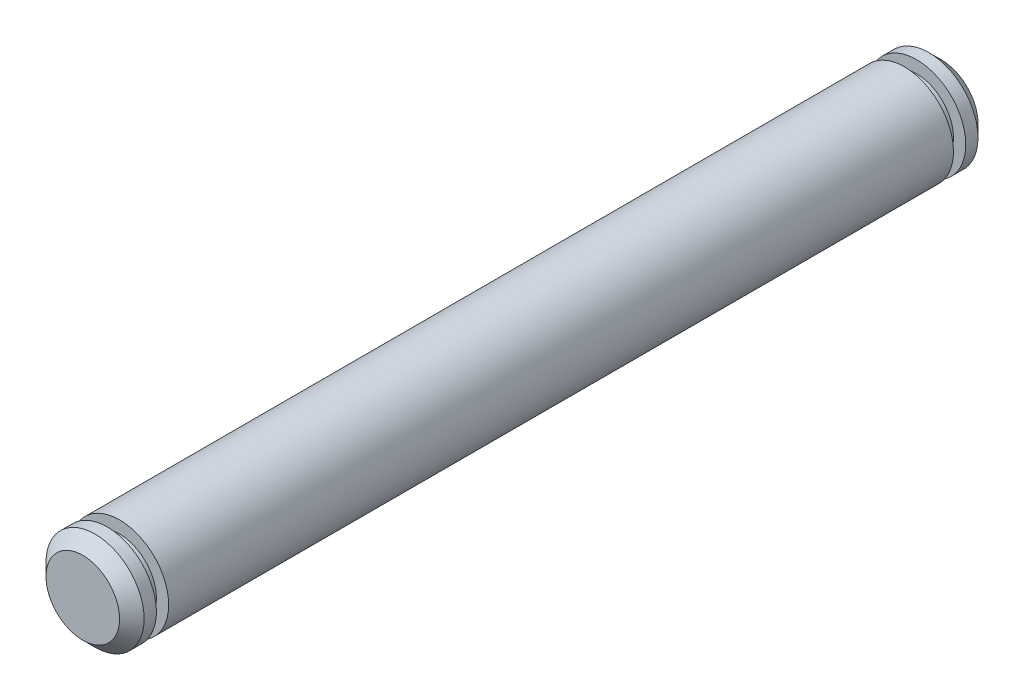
ISO-10303-21;
HEADER;
FILE_DESCRIPTION(('STEP AP214'),'2;1');
FILE_NAME('part.step','',(''),(''),'','','');
FILE_SCHEMA(('AUTOMOTIVE_DESIGN { 1 0 10303 214 1 1 1 1 }'));
ENDSEC;
DATA;
#1=APPLICATION_CONTEXT('core data for automotive mechanical design processes');
#2=APPLICATION_PROTOCOL_DEFINITION('international standard','automotive_design',2000,#1);
#3=PRODUCT_CONTEXT('',#1,'mechanical');
#4=PRODUCT('Part','Part','',(#3));
#5=PRODUCT_RELATED_PRODUCT_CATEGORY('part','',(#4));
#6=PRODUCT_DEFINITION_FORMATION('','',#4);
#7=PRODUCT_DEFINITION_CONTEXT('part definition',#1,'design');
#8=PRODUCT_DEFINITION('design','',#6,#7);
#9=PRODUCT_DEFINITION_SHAPE('','',#8);
#10=(LENGTH_UNIT() NAMED_UNIT(*) SI_UNIT(.MILLI.,.METRE.));
#11=(NAMED_UNIT(*) PLANE_ANGLE_UNIT() SI_UNIT($,.RADIAN.));
#12=(NAMED_UNIT(*) SI_UNIT($,.STERADIAN.) SOLID_ANGLE_UNIT());
#13=UNCERTAINTY_MEASURE_WITH_UNIT(LENGTH_MEASURE(1.E-05),#10,'distance_accuracy_value','');
#14=(GEOMETRIC_REPRESENTATION_CONTEXT(3) GLOBAL_UNCERTAINTY_ASSIGNED_CONTEXT((#13)) GLOBAL_UNIT_ASSIGNED_CONTEXT((#10,
#11,#12)) REPRESENTATION_CONTEXT('',''));
#15=CARTESIAN_POINT('',(0.,0.,0.));
#16=DIRECTION('',(0.,0.,1.));
#17=DIRECTION('',(1.,0.,0.));
#18=AXIS2_PLACEMENT_3D('',#15,#16,#17);
#19=CARTESIAN_POINT('',(-8.,0.,67.));
#20=DIRECTION('',(0.,0.,1.));
#21=DIRECTION('',(1.,0.,0.));
#22=AXIS2_PLACEMENT_3D('',#19,#20,#21);
#23=PLANE('',#22);
#24=CARTESIAN_POINT('',(0.,0.,67.));
#25=DIRECTION('',(0.,0.,-1.));
#26=DIRECTION('',(-1.,0.,0.));
#27=AXIS2_PLACEMENT_3D('',#24,#25,#26);
#28=CIRCLE('',#27,3.);
#29=CARTESIAN_POINT('',(-3.,0.,67.));
#30=VERTEX_POINT('',#29);
#31=EDGE_CURVE('E53',#30,#30,#28,.T.);
#32=ORIENTED_EDGE('',*,*,#31,.T.);
#33=EDGE_LOOP('',(#32));
#34=FACE_BOUND('',#33,.T.);
#35=CARTESIAN_POINT('',(0.,0.,67.));
#36=DIRECTION('',(0.,0.,1.));
#37=DIRECTION('',(1.,0.,0.));
#38=AXIS2_PLACEMENT_3D('',#35,#36,#37);
#39=CIRCLE('',#38,4.);
#40=CARTESIAN_POINT('',(4.,0.,67.));
#41=VERTEX_POINT('',#40);
#42=EDGE_CURVE('E46',#41,#41,#39,.T.);
#43=ORIENTED_EDGE('',*,*,#42,.T.);
#44=EDGE_LOOP('',(#43));
#45=FACE_BOUND('',#44,.T.);
#46=ADVANCED_FACE('F25',(#34,#45),#23,.T.);
#47=CARTESIAN_POINT('',(-3.,0.,68.));
#48=DIRECTION('',(0.,0.,-1.));
#49=DIRECTION('',(-1.,0.,0.));
#50=AXIS2_PLACEMENT_3D('',#47,#48,#49);
#51=PLANE('',#50);
#52=CARTESIAN_POINT('',(0.,0.,68.));
#53=DIRECTION('',(0.,0.,-1.));
#54=DIRECTION('',(-1.,0.,0.));
#55=AXIS2_PLACEMENT_3D('',#52,#53,#54);
#56=CIRCLE('',#55,3.);
#57=CARTESIAN_POINT('',(-3.,0.,68.));
#58=VERTEX_POINT('',#57);
#59=EDGE_CURVE('E66',#58,#58,#56,.T.);
#60=ORIENTED_EDGE('',*,*,#59,.F.);
#61=EDGE_LOOP('',(#60));
#62=FACE_BOUND('',#61,.T.);
#63=CARTESIAN_POINT('',(0.,0.,68.));
#64=DIRECTION('',(0.,0.,-1.));
#65=DIRECTION('',(-1.,0.,0.));
#66=AXIS2_PLACEMENT_3D('',#63,#64,#65);
#67=CIRCLE('',#66,4.);
#68=CARTESIAN_POINT('',(-4.,0.,68.));
#69=VERTEX_POINT('',#68);
#70=EDGE_CURVE('E50',#69,#69,#67,.T.);
#71=ORIENTED_EDGE('',*,*,#70,.T.);
#72=EDGE_LOOP('',(#71));
#73=FACE_BOUND('',#72,.T.);
#74=ADVANCED_FACE('F72',(#62,#73),#51,.T.);
#75=CARTESIAN_POINT('',(0.,0.,-3.57932841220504));
#76=DIRECTION('',(0.,0.,-1.));
#77=DIRECTION('',(-1.,0.,0.));
#78=AXIS2_PLACEMENT_3D('',#75,#76,#77);
#79=CYLINDRICAL_SURFACE('',#78,3.);
#80=ORIENTED_EDGE('',*,*,#31,.F.);
#81=EDGE_LOOP('',(#80));
#82=FACE_BOUND('',#81,.T.);
#83=ORIENTED_EDGE('',*,*,#59,.T.);
#84=EDGE_LOOP('',(#83));
#85=FACE_BOUND('',#84,.T.);
#86=ADVANCED_FACE('F70',(#82,#85),#79,.T.);
#87=CARTESIAN_POINT('',(0.,0.,70.));
#88=DIRECTION('',(0.,0.,1.));
#89=DIRECTION('',(1.,0.,0.));
#90=AXIS2_PLACEMENT_3D('',#87,#88,#89);
#91=PLANE('',#90);
#92=CARTESIAN_POINT('',(0.,0.,70.));
#93=DIRECTION('',(0.,0.,1.));
#94=DIRECTION('',(1.,0.,0.));
#95=AXIS2_PLACEMENT_3D('',#92,#93,#94);
#96=CIRCLE('',#95,2.99999999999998);
#97=CARTESIAN_POINT('',(2.99999999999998,0.,70.));
#98=VERTEX_POINT('',#97);
#99=EDGE_CURVE('E32',#98,#98,#96,.T.);
#100=ORIENTED_EDGE('',*,*,#99,.T.);
#101=EDGE_LOOP('',(#100));
#102=FACE_BOUND('',#101,.T.);
#103=ADVANCED_FACE('F80',(#102),#91,.T.);
#104=CARTESIAN_POINT('',(0.,0.,70.));
#105=DIRECTION('',(0.,0.,-1.));
#106=DIRECTION('',(-1.,0.,0.));
#107=AXIS2_PLACEMENT_3D('',#104,#105,#106);
#108=CYLINDRICAL_SURFACE('',#107,4.);
#109=CARTESIAN_POINT('',(0.,0.,69.));
#110=DIRECTION('',(0.,0.,1.));
#111=DIRECTION('',(1.,0.,0.));
#112=AXIS2_PLACEMENT_3D('',#109,#110,#111);
#113=CIRCLE('',#112,4.);
#114=CARTESIAN_POINT('',(4.,0.,69.));
#115=VERTEX_POINT('',#114);
#116=EDGE_CURVE('E10',#115,#115,#113,.F.);
#117=ORIENTED_EDGE('',*,*,#116,.T.);
#118=EDGE_LOOP('',(#117));
#119=FACE_BOUND('',#118,.T.);
#120=ORIENTED_EDGE('',*,*,#70,.F.);
#121=EDGE_LOOP('',(#120));
#122=FACE_BOUND('',#121,.T.);
#123=ADVANCED_FACE('F78',(#119,#122),#108,.T.);
#124=CARTESIAN_POINT('',(0.,0.,3.));
#125=DIRECTION('',(0.,0.,-1.));
#126=DIRECTION('',(-1.,0.,0.));
#127=AXIS2_PLACEMENT_3D('',#124,#125,#126);
#128=CIRCLE('',#127,4.);
#129=CARTESIAN_POINT('',(-4.,0.,3.));
#130=VERTEX_POINT('',#129);
#131=EDGE_CURVE('E45',#130,#130,#128,.T.);
#132=ORIENTED_EDGE('',*,*,#131,.F.);
#133=EDGE_LOOP('',(#132));
#134=FACE_BOUND('',#133,.T.);
#135=ORIENTED_EDGE('',*,*,#42,.F.);
#136=EDGE_LOOP('',(#135));
#137=FACE_BOUND('',#136,.T.);
#138=ADVANCED_FACE('F27',(#134,#137),#108,.T.);
#139=CARTESIAN_POINT('',(-3.,0.,3.));
#140=DIRECTION('',(0.,0.,-1.));
#141=DIRECTION('',(-1.,0.,0.));
#142=AXIS2_PLACEMENT_3D('',#139,#140,#141);
#143=PLANE('',#142);
#144=CARTESIAN_POINT('',(0.,0.,3.));
#145=DIRECTION('',(0.,0.,-1.));
#146=DIRECTION('',(-1.,0.,0.));
#147=AXIS2_PLACEMENT_3D('',#144,#145,#146);
#148=CIRCLE('',#147,3.);
#149=CARTESIAN_POINT('',(-3.,0.,3.));
#150=VERTEX_POINT('',#149);
#151=EDGE_CURVE('E59',#150,#150,#148,.T.);
#152=ORIENTED_EDGE('',*,*,#151,.F.);
#153=EDGE_LOOP('',(#152));
#154=FACE_BOUND('',#153,.T.);
#155=ORIENTED_EDGE('',*,*,#131,.T.);
#156=EDGE_LOOP('',(#155));
#157=FACE_BOUND('',#156,.T.);
#158=ADVANCED_FACE('F86',(#154,#157),#143,.T.);
#159=CARTESIAN_POINT('',(-8.,0.,2.));
#160=DIRECTION('',(0.,0.,1.));
#161=DIRECTION('',(1.,0.,0.));
#162=AXIS2_PLACEMENT_3D('',#159,#160,#161);
#163=PLANE('',#162);
#164=CARTESIAN_POINT('',(0.,0.,2.));
#165=DIRECTION('',(0.,0.,-1.));
#166=DIRECTION('',(-1.,0.,0.));
#167=AXIS2_PLACEMENT_3D('',#164,#165,#166);
#168=CIRCLE('',#167,3.);
#169=CARTESIAN_POINT('',(-3.,0.,2.));
#170=VERTEX_POINT('',#169);
#171=EDGE_CURVE('E49',#170,#170,#168,.T.);
#172=ORIENTED_EDGE('',*,*,#171,.T.);
#173=EDGE_LOOP('',(#172));
#174=FACE_BOUND('',#173,.T.);
#175=CARTESIAN_POINT('',(0.,0.,2.));
#176=DIRECTION('',(0.,0.,1.));
#177=DIRECTION('',(1.,0.,0.));
#178=AXIS2_PLACEMENT_3D('',#175,#176,#177);
#179=CIRCLE('',#178,4.);
#180=CARTESIAN_POINT('',(4.,0.,2.));
#181=VERTEX_POINT('',#180);
#182=EDGE_CURVE('E56',#181,#181,#179,.T.);
#183=ORIENTED_EDGE('',*,*,#182,.T.);
#184=EDGE_LOOP('',(#183));
#185=FACE_BOUND('',#184,.T.);
#186=ADVANCED_FACE('F100',(#174,#185),#163,.T.);
#187=CARTESIAN_POINT('',(0.,0.,-3.39366440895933));
#188=DIRECTION('',(0.,0.,-1.));
#189=DIRECTION('',(-1.,0.,0.));
#190=AXIS2_PLACEMENT_3D('',#187,#188,#189);
#191=CYLINDRICAL_SURFACE('',#190,3.);
#192=ORIENTED_EDGE('',*,*,#171,.F.);
#193=EDGE_LOOP('',(#192));
#194=FACE_BOUND('',#193,.T.);
#195=ORIENTED_EDGE('',*,*,#151,.T.);
#196=EDGE_LOOP('',(#195));
#197=FACE_BOUND('',#196,.T.);
#198=ADVANCED_FACE('F103',(#194,#197),#191,.T.);
#199=CARTESIAN_POINT('',(0.,0.,0.));
#200=DIRECTION('',(0.,0.,1.));
#201=DIRECTION('',(1.,0.,0.));
#202=AXIS2_PLACEMENT_3D('',#199,#200,#201);
#203=PLANE('',#202);
#204=CARTESIAN_POINT('',(0.,0.,0.));
#205=DIRECTION('',(0.,0.,1.));
#206=DIRECTION('',(1.,0.,0.));
#207=AXIS2_PLACEMENT_3D('',#204,#205,#206);
#208=CIRCLE('',#207,2.99999999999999);
#209=CARTESIAN_POINT('',(2.99999999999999,0.,0.));
#210=VERTEX_POINT('',#209);
#211=EDGE_CURVE('E36',#210,#210,#208,.F.);
#212=ORIENTED_EDGE('',*,*,#211,.T.);
#213=EDGE_LOOP('',(#212));
#214=FACE_BOUND('',#213,.T.);
#215=ADVANCED_FACE('F90',(#214),#203,.F.);
#216=CARTESIAN_POINT('',(0.,0.,1.00000000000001));
#217=DIRECTION('',(0.,0.,1.));
#218=DIRECTION('',(1.,0.,0.));
#219=AXIS2_PLACEMENT_3D('',#216,#217,#218);
#220=CIRCLE('',#219,4.);
#221=CARTESIAN_POINT('',(4.,0.,1.00000000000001));
#222=VERTEX_POINT('',#221);
#223=EDGE_CURVE('E40',#222,#222,#220,.T.);
#224=ORIENTED_EDGE('',*,*,#223,.T.);
#225=EDGE_LOOP('',(#224));
#226=FACE_BOUND('',#225,.T.);
#227=ORIENTED_EDGE('',*,*,#182,.F.);
#228=EDGE_LOOP('',(#227));
#229=FACE_BOUND('',#228,.T.);
#230=ADVANCED_FACE('F81',(#226,#229),#108,.T.);
#231=CARTESIAN_POINT('',(0.,0.,1.00000000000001));
#232=DIRECTION('',(0.,0.,1.));
#233=DIRECTION('',(1.,0.,0.));
#234=AXIS2_PLACEMENT_3D('',#231,#232,#233);
#235=CONICAL_SURFACE('',#234,4.,0.785398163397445);
#236=ORIENTED_EDGE('',*,*,#211,.F.);
#237=EDGE_LOOP('',(#236));
#238=FACE_BOUND('',#237,.T.);
#239=ORIENTED_EDGE('',*,*,#223,.F.);
#240=EDGE_LOOP('',(#239));
#241=FACE_BOUND('',#240,.T.);
#242=ADVANCED_FACE('F89',(#238,#241),#235,.T.);
#243=CARTESIAN_POINT('',(0.,0.,70.));
#244=DIRECTION('',(0.,0.,-1.));
#245=DIRECTION('',(-1.,0.,0.));
#246=AXIS2_PLACEMENT_3D('',#243,#244,#245);
#247=CONICAL_SURFACE('',#246,2.99999999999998,0.785398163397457);
#248=ORIENTED_EDGE('',*,*,#116,.F.);
#249=EDGE_LOOP('',(#248));
#250=FACE_BOUND('',#249,.T.);
#251=ORIENTED_EDGE('',*,*,#99,.F.);
#252=EDGE_LOOP('',(#251));
#253=FACE_BOUND('',#252,.T.);
#254=ADVANCED_FACE('F119',(#250,#253),#247,.T.);
#255=CLOSED_SHELL('',(#46,#74,#86,#103,#123,#138,#158,#186,#198,#215,#230,#242,#254));
#256=MANIFOLD_SOLID_BREP('B2',#255);
#257=ADVANCED_BREP_SHAPE_REPRESENTATION('',(#18,#256),#14);
#258=SHAPE_DEFINITION_REPRESENTATION(#9,#257);
ENDSEC;
END-ISO-10303-21;
